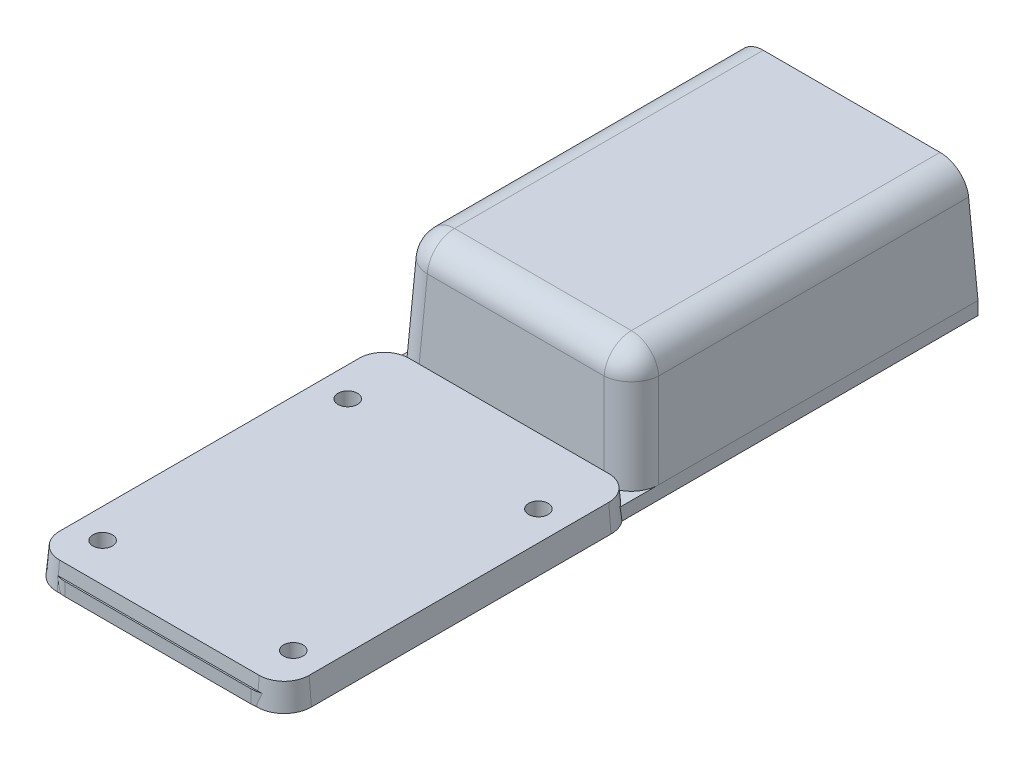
ISO-10303-21;
HEADER;
FILE_DESCRIPTION(('STEP AP214'),'2;1');
FILE_NAME('part.step','',(''),(''),'','','');
FILE_SCHEMA(('AUTOMOTIVE_DESIGN { 1 0 10303 214 1 1 1 1 }'));
ENDSEC;
DATA;
#1=APPLICATION_CONTEXT('core data for automotive mechanical design processes');
#2=APPLICATION_PROTOCOL_DEFINITION('international standard','automotive_design',2000,#1);
#3=PRODUCT_CONTEXT('',#1,'mechanical');
#4=PRODUCT('Part','Part','',(#3));
#5=PRODUCT_RELATED_PRODUCT_CATEGORY('part','',(#4));
#6=PRODUCT_DEFINITION_FORMATION('','',#4);
#7=PRODUCT_DEFINITION_CONTEXT('part definition',#1,'design');
#8=PRODUCT_DEFINITION('design','',#6,#7);
#9=PRODUCT_DEFINITION_SHAPE('','',#8);
#10=(LENGTH_UNIT() NAMED_UNIT(*) SI_UNIT(.MILLI.,.METRE.));
#11=(NAMED_UNIT(*) PLANE_ANGLE_UNIT() SI_UNIT($,.RADIAN.));
#12=(NAMED_UNIT(*) SI_UNIT($,.STERADIAN.) SOLID_ANGLE_UNIT());
#13=UNCERTAINTY_MEASURE_WITH_UNIT(LENGTH_MEASURE(1.E-05),#10,'distance_accuracy_value','');
#14=(GEOMETRIC_REPRESENTATION_CONTEXT(3) GLOBAL_UNCERTAINTY_ASSIGNED_CONTEXT((#13)) GLOBAL_UNIT_ASSIGNED_CONTEXT((#10,
#11,#12)) REPRESENTATION_CONTEXT('',''));
#15=CARTESIAN_POINT('',(0.,0.,0.));
#16=DIRECTION('',(0.,0.,1.));
#17=DIRECTION('',(1.,0.,0.));
#18=AXIS2_PLACEMENT_3D('',#15,#16,#17);
#19=CARTESIAN_POINT('',(20.7387806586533,2.9,33.0766280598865));
#20=DIRECTION('',(0.,-1.,0.));
#21=DIRECTION('',(0.,0.,-1.));
#22=AXIS2_PLACEMENT_3D('',#19,#20,#21);
#23=PLANE('',#22);
#24=CARTESIAN_POINT('',(-22.,2.9,-33.));
#25=DIRECTION('',(0.,-1.,0.));
#26=DIRECTION('',(0.,0.,-1.));
#27=AXIS2_PLACEMENT_3D('',#24,#25,#26);
#28=CIRCLE('',#27,5.74628287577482);
#29=CARTESIAN_POINT('',(-26.2612193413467,2.9,-36.8550974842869));
#30=VERTEX_POINT('',#29);
#31=CARTESIAN_POINT('',(-22.,2.9,-38.7462828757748));
#32=VERTEX_POINT('',#31);
#33=EDGE_CURVE('E319',#30,#32,#28,.T.);
#34=ORIENTED_EDGE('',*,*,#33,.T.);
#35=DIRECTION('',(-1.,0.,0.));
#36=VECTOR('',#35,1.);
#37=CARTESIAN_POINT('',(22.,2.9,-38.7462828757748));
#38=LINE('',#37,#36);
#39=CARTESIAN_POINT('',(-20.269445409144,2.9,-38.7462828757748));
#40=VERTEX_POINT('',#39);
#41=EDGE_CURVE('E11',#32,#40,#38,.F.);
#42=ORIENTED_EDGE('',*,*,#41,.T.);
#43=CARTESIAN_POINT('',(-20.2529852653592,2.9,-44.7545169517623));
#44=DIRECTION('',(0.,-1.,0.));
#45=DIRECTION('',(-0.707106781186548,0.,0.707106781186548));
#46=AXIS2_PLACEMENT_3D('',#43,#44,#45);
#47=ELLIPSE('',#46,6.0164568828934,6.);
#48=CARTESIAN_POINT('',(-26.2612193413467,2.9,-44.7380600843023));
#49=VERTEX_POINT('',#48);
#50=EDGE_CURVE('E544',#40,#49,#47,.T.);
#51=ORIENTED_EDGE('',*,*,#50,.T.);
#52=DIRECTION('',(0.,0.,-1.));
#53=VECTOR('',#52,1.);
#54=CARTESIAN_POINT('',(-26.2612193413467,2.9,33.0766280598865));
#55=LINE('',#54,#53);
#56=EDGE_CURVE('E293',#30,#49,#55,.T.);
#57=ORIENTED_EDGE('',*,*,#56,.F.);
#58=EDGE_LOOP('',(#34,#42,#51,#57));
#59=FACE_BOUND('',#58,.T.);
#60=ADVANCED_FACE('F35',(#59),#23,.F.);
#61=DIRECTION('',(0.,0.,1.));
#62=VECTOR('',#61,1.);
#63=CARTESIAN_POINT('',(26.7387806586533,2.9,33.0766280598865));
#64=LINE('',#63,#62);
#65=CARTESIAN_POINT('',(26.7387806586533,2.9,-44.7380600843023));
#66=VERTEX_POINT('',#65);
#67=CARTESIAN_POINT('',(26.7387806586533,2.9,-36.2501884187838));
#68=VERTEX_POINT('',#67);
#69=EDGE_CURVE('E298',#66,#68,#64,.T.);
#70=ORIENTED_EDGE('',*,*,#69,.F.);
#71=CARTESIAN_POINT('',(20.7305465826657,2.9,-44.7545169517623));
#72=DIRECTION('',(0.,-1.,0.));
#73=DIRECTION('',(0.707106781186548,0.,0.707106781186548));
#74=AXIS2_PLACEMENT_3D('',#71,#72,#73);
#75=ELLIPSE('',#74,6.0164568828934,6.);
#76=CARTESIAN_POINT('',(20.7470034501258,2.9,-38.7462828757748));
#77=VERTEX_POINT('',#76);
#78=EDGE_CURVE('E542',#66,#77,#75,.T.);
#79=ORIENTED_EDGE('',*,*,#78,.T.);
#80=DIRECTION('',(1.,0.,0.));
#81=VECTOR('',#80,1.);
#82=CARTESIAN_POINT('',(20.7387806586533,2.9,-38.7462828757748));
#83=LINE('',#82,#81);
#84=CARTESIAN_POINT('',(22.,2.9,-38.7462828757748));
#85=VERTEX_POINT('',#84);
#86=EDGE_CURVE('E45',#85,#77,#83,.F.);
#87=ORIENTED_EDGE('',*,*,#86,.F.);
#88=CARTESIAN_POINT('',(22.,2.9,-33.));
#89=DIRECTION('',(0.,-1.,0.));
#90=DIRECTION('',(0.,0.,-1.));
#91=AXIS2_PLACEMENT_3D('',#88,#89,#90);
#92=CIRCLE('',#91,5.74628287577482);
#93=EDGE_CURVE('E330',#85,#68,#92,.T.);
#94=ORIENTED_EDGE('',*,*,#93,.T.);
#95=EDGE_LOOP('',(#70,#79,#87,#94));
#96=FACE_BOUND('',#95,.T.);
#97=ADVANCED_FACE('F440',(#96),#23,.F.);
#98=CARTESIAN_POINT('',(22.,0.,39.));
#99=DIRECTION('',(0.,0.0871557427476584,0.996194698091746));
#100=DIRECTION('',(0.,-0.996194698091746,0.0871557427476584));
#101=AXIS2_PLACEMENT_3D('',#98,#99,#100);
#102=PLANE('',#101);
#103=DIRECTION('',(0.,-0.996194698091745,0.0871557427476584));
#104=VECTOR('',#103,1.);
#105=CARTESIAN_POINT('',(22.,0.,39.));
#106=LINE('',#105,#104);
#107=CARTESIAN_POINT('',(22.,0.656378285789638,38.9425743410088));
#108=VERTEX_POINT('',#107);
#109=CARTESIAN_POINT('',(22.,0.,39.));
#110=VERTEX_POINT('',#109);
#111=EDGE_CURVE('E495',#108,#110,#106,.T.);
#112=ORIENTED_EDGE('',*,*,#111,.F.);
#113=CARTESIAN_POINT('',(20.7387806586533,67.7044510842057,33.0766280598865));
#114=DIRECTION('',(0.,0.0871557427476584,0.996194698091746));
#115=DIRECTION('',(0.,-0.996194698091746,0.0871557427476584));
#116=AXIS2_PLACEMENT_3D('',#113,#114,#115);
#117=ELLIPSE('',#116,68.842279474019,6.);
#118=CARTESIAN_POINT('',(21.6946388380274,0.,39.));
#119=VERTEX_POINT('',#118);
#120=EDGE_CURVE('E391',#108,#119,#117,.F.);
#121=ORIENTED_EDGE('',*,*,#120,.T.);
#122=DIRECTION('',(1.,0.,0.));
#123=VECTOR('',#122,1.);
#124=CARTESIAN_POINT('',(22.,0.,39.));
#125=LINE('',#124,#123);
#126=EDGE_CURVE('E659',#119,#110,#125,.T.);
#127=ORIENTED_EDGE('',*,*,#126,.T.);
#128=EDGE_LOOP('',(#112,#121,#127));
#129=FACE_BOUND('',#128,.T.);
#130=ADVANCED_FACE('F410',(#129),#102,.T.);
#131=DIRECTION('',(1.,0.,0.));
#132=VECTOR('',#131,1.);
#133=CARTESIAN_POINT('',(22.,2.9,38.7462828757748));
#134=LINE('',#133,#132);
#135=CARTESIAN_POINT('',(22.,2.9,38.7462828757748));
#136=VERTEX_POINT('',#135);
#137=CARTESIAN_POINT('',(-22.,2.9,38.7462828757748));
#138=VERTEX_POINT('',#137);
#139=EDGE_CURVE('E336',#136,#138,#134,.F.);
#140=ORIENTED_EDGE('',*,*,#139,.F.);
#141=CARTESIAN_POINT('',(22.,5.8,38.4925657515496));
#142=VERTEX_POINT('',#141);
#143=EDGE_CURVE('E459',#142,#136,#106,.T.);
#144=ORIENTED_EDGE('',*,*,#143,.F.);
#145=DIRECTION('',(-1.,0.,0.));
#146=VECTOR('',#145,1.);
#147=CARTESIAN_POINT('',(22.,5.8,38.4925657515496));
#148=LINE('',#147,#146);
#149=CARTESIAN_POINT('',(-22.,5.8,38.4925657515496));
#150=VERTEX_POINT('',#149);
#151=EDGE_CURVE('E463',#150,#142,#148,.F.);
#152=ORIENTED_EDGE('',*,*,#151,.F.);
#153=DIRECTION('',(0.,-0.996194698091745,0.0871557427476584));
#154=VECTOR('',#153,1.);
#155=CARTESIAN_POINT('',(-22.,0.,39.));
#156=LINE('',#155,#154);
#157=EDGE_CURVE('E462',#150,#138,#156,.T.);
#158=ORIENTED_EDGE('',*,*,#157,.T.);
#159=EDGE_LOOP('',(#140,#144,#152,#158));
#160=FACE_BOUND('',#159,.T.);
#161=ADVANCED_FACE('F411',(#160),#102,.T.);
#162=CARTESIAN_POINT('',(22.,0.,-39.));
#163=DIRECTION('',(0.,0.0871557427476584,-0.996194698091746));
#164=DIRECTION('',(0.,0.996194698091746,0.0871557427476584));
#165=AXIS2_PLACEMENT_3D('',#162,#163,#164);
#166=PLANE('',#165);
#167=DIRECTION('',(-1.,0.,0.));
#168=VECTOR('',#167,1.);
#169=CARTESIAN_POINT('',(22.,2.9,-38.7462828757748));
#170=LINE('',#169,#168);
#171=EDGE_CURVE('E53',#40,#77,#170,.F.);
#172=ORIENTED_EDGE('',*,*,#171,.F.);
#173=ORIENTED_EDGE('',*,*,#41,.F.);
#174=DIRECTION('',(0.,-0.996194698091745,-0.0871557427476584));
#175=VECTOR('',#174,1.);
#176=CARTESIAN_POINT('',(-22.,0.,-39.));
#177=LINE('',#176,#175);
#178=CARTESIAN_POINT('',(-22.,5.8,-38.4925657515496));
#179=VERTEX_POINT('',#178);
#180=EDGE_CURVE('E483',#179,#32,#177,.T.);
#181=ORIENTED_EDGE('',*,*,#180,.F.);
#182=DIRECTION('',(1.,0.,0.));
#183=VECTOR('',#182,1.);
#184=CARTESIAN_POINT('',(22.,5.8,-38.4925657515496));
#185=LINE('',#184,#183);
#186=CARTESIAN_POINT('',(22.,5.8,-38.4925657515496));
#187=VERTEX_POINT('',#186);
#188=EDGE_CURVE('E506',#187,#179,#185,.F.);
#189=ORIENTED_EDGE('',*,*,#188,.F.);
#190=DIRECTION('',(0.,-0.996194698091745,-0.0871557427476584));
#191=VECTOR('',#190,1.);
#192=CARTESIAN_POINT('',(22.,0.,-39.));
#193=LINE('',#192,#191);
#194=EDGE_CURVE('E486',#187,#85,#193,.T.);
#195=ORIENTED_EDGE('',*,*,#194,.T.);
#196=ORIENTED_EDGE('',*,*,#86,.T.);
#197=EDGE_LOOP('',(#172,#173,#181,#189,#195,#196));
#198=FACE_BOUND('',#197,.T.);
#199=ADVANCED_FACE('F575',(#198),#166,.T.);
#200=CARTESIAN_POINT('',(-21.,5.8,30.));
#201=DIRECTION('',(0.,1.,0.));
#202=DIRECTION('',(0.,0.,1.));
#203=AXIS2_PLACEMENT_3D('',#200,#201,#202);
#204=CYLINDRICAL_SURFACE('',#203,2.14999999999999);
#205=CARTESIAN_POINT('',(-21.,5.8,30.));
#206=DIRECTION('',(0.,1.,0.));
#207=DIRECTION('',(0.,0.,1.));
#208=AXIS2_PLACEMENT_3D('',#205,#206,#207);
#209=CIRCLE('',#208,2.14999999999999);
#210=CARTESIAN_POINT('',(-21.,5.8,32.15));
#211=VERTEX_POINT('',#210);
#212=EDGE_CURVE('E660',#211,#211,#209,.T.);
#213=ORIENTED_EDGE('',*,*,#212,.T.);
#214=EDGE_LOOP('',(#213));
#215=FACE_BOUND('',#214,.T.);
#216=CARTESIAN_POINT('',(-21.,0.,30.));
#217=DIRECTION('',(0.,1.,0.));
#218=DIRECTION('',(0.,0.,1.));
#219=AXIS2_PLACEMENT_3D('',#216,#217,#218);
#220=CIRCLE('',#219,2.15);
#221=CARTESIAN_POINT('',(-21.,0.,32.15));
#222=VERTEX_POINT('',#221);
#223=EDGE_CURVE('E280',#222,#222,#220,.T.);
#224=ORIENTED_EDGE('',*,*,#223,.F.);
#225=EDGE_LOOP('',(#224));
#226=FACE_BOUND('',#225,.T.);
#227=ADVANCED_FACE('F639',(#215,#226),#204,.F.);
#228=CARTESIAN_POINT('',(21.,5.8,-24.));
#229=DIRECTION('',(0.,1.,0.));
#230=DIRECTION('',(0.,0.,1.));
#231=AXIS2_PLACEMENT_3D('',#228,#229,#230);
#232=CYLINDRICAL_SURFACE('',#231,2.14999999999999);
#233=CARTESIAN_POINT('',(21.,5.8,-24.));
#234=DIRECTION('',(0.,1.,0.));
#235=DIRECTION('',(0.,0.,1.));
#236=AXIS2_PLACEMENT_3D('',#233,#234,#235);
#237=CIRCLE('',#236,2.14999999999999);
#238=CARTESIAN_POINT('',(21.,5.8,-21.85));
#239=VERTEX_POINT('',#238);
#240=EDGE_CURVE('E665',#239,#239,#237,.T.);
#241=ORIENTED_EDGE('',*,*,#240,.T.);
#242=EDGE_LOOP('',(#241));
#243=FACE_BOUND('',#242,.T.);
#244=CARTESIAN_POINT('',(21.,0.,-24.));
#245=DIRECTION('',(0.,1.,0.));
#246=DIRECTION('',(0.,0.,1.));
#247=AXIS2_PLACEMENT_3D('',#244,#245,#246);
#248=CIRCLE('',#247,2.15);
#249=CARTESIAN_POINT('',(21.,0.,-21.85));
#250=VERTEX_POINT('',#249);
#251=EDGE_CURVE('E274',#250,#250,#248,.T.);
#252=ORIENTED_EDGE('',*,*,#251,.F.);
#253=EDGE_LOOP('',(#252));
#254=FACE_BOUND('',#253,.T.);
#255=ADVANCED_FACE('F692',(#243,#254),#232,.F.);
#256=CARTESIAN_POINT('',(21.,5.8,30.));
#257=DIRECTION('',(0.,1.,0.));
#258=DIRECTION('',(0.,0.,1.));
#259=AXIS2_PLACEMENT_3D('',#256,#257,#258);
#260=CYLINDRICAL_SURFACE('',#259,2.14999999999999);
#261=CARTESIAN_POINT('',(21.,5.8,30.));
#262=DIRECTION('',(0.,1.,0.));
#263=DIRECTION('',(0.,0.,1.));
#264=AXIS2_PLACEMENT_3D('',#261,#262,#263);
#265=CIRCLE('',#264,2.14999999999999);
#266=CARTESIAN_POINT('',(21.,5.8,32.15));
#267=VERTEX_POINT('',#266);
#268=EDGE_CURVE('E684',#267,#267,#265,.T.);
#269=ORIENTED_EDGE('',*,*,#268,.T.);
#270=EDGE_LOOP('',(#269));
#271=FACE_BOUND('',#270,.T.);
#272=CARTESIAN_POINT('',(21.,0.,30.));
#273=DIRECTION('',(0.,1.,0.));
#274=DIRECTION('',(0.,0.,1.));
#275=AXIS2_PLACEMENT_3D('',#272,#273,#274);
#276=CIRCLE('',#275,2.15);
#277=CARTESIAN_POINT('',(21.,0.,32.15));
#278=VERTEX_POINT('',#277);
#279=EDGE_CURVE('E277',#278,#278,#276,.T.);
#280=ORIENTED_EDGE('',*,*,#279,.F.);
#281=EDGE_LOOP('',(#280));
#282=FACE_BOUND('',#281,.T.);
#283=ADVANCED_FACE('F711',(#271,#282),#260,.F.);
#284=CARTESIAN_POINT('',(-21.,5.8,-24.));
#285=DIRECTION('',(0.,1.,0.));
#286=DIRECTION('',(0.,0.,1.));
#287=AXIS2_PLACEMENT_3D('',#284,#285,#286);
#288=CYLINDRICAL_SURFACE('',#287,2.14999999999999);
#289=CARTESIAN_POINT('',(-21.,5.8,-24.));
#290=DIRECTION('',(0.,1.,0.));
#291=DIRECTION('',(0.,0.,1.));
#292=AXIS2_PLACEMENT_3D('',#289,#290,#291);
#293=CIRCLE('',#292,2.14999999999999);
#294=CARTESIAN_POINT('',(-21.,5.8,-21.85));
#295=VERTEX_POINT('',#294);
#296=EDGE_CURVE('E682',#295,#295,#293,.T.);
#297=ORIENTED_EDGE('',*,*,#296,.T.);
#298=EDGE_LOOP('',(#297));
#299=FACE_BOUND('',#298,.T.);
#300=CARTESIAN_POINT('',(-21.,0.,-24.));
#301=DIRECTION('',(0.,1.,0.));
#302=DIRECTION('',(0.,0.,1.));
#303=AXIS2_PLACEMENT_3D('',#300,#301,#302);
#304=CIRCLE('',#303,2.15);
#305=CARTESIAN_POINT('',(-21.,0.,-21.85));
#306=VERTEX_POINT('',#305);
#307=EDGE_CURVE('E267',#306,#306,#304,.T.);
#308=ORIENTED_EDGE('',*,*,#307,.F.);
#309=EDGE_LOOP('',(#308));
#310=FACE_BOUND('',#309,.T.);
#311=ADVANCED_FACE('F382',(#299,#310),#288,.F.);
#312=CARTESIAN_POINT('',(-22.,0.,33.));
#313=DIRECTION('',(0.,-1.,0.));
#314=DIRECTION('',(0.,0.,1.));
#315=AXIS2_PLACEMENT_3D('',#312,#313,#314);
#316=CONICAL_SURFACE('',#315,6.,0.0872664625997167);
#317=CARTESIAN_POINT('',(-22.,2.06704177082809,38.819157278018));
#318=VERTEX_POINT('',#317);
#319=CARTESIAN_POINT('',(-22.,0.,39.));
#320=VERTEX_POINT('',#319);
#321=EDGE_CURVE('E468',#318,#320,#156,.T.);
#322=ORIENTED_EDGE('',*,*,#321,.F.);
#323=CARTESIAN_POINT('',(-21.9998,2.06634959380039,38.8192178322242));
#324=CARTESIAN_POINT('',(-22.0399545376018,2.20531903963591,38.8070604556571));
#325=CARTESIAN_POINT('',(-22.0799640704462,2.34429129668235,38.7944880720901));
#326=CARTESIAN_POINT('',(-22.1596931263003,2.62224143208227,38.7685132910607));
#327=CARTESIAN_POINT('',(-22.1994126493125,2.7612193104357,38.7551108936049));
#328=CARTESIAN_POINT('',(-22.2389871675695,2.9002,38.7412934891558));
#329=B_SPLINE_CURVE_WITH_KNOTS('',3,(#323,#324,#325,#326,#327,#328),.UNSPECIFIED.,.F.,.F.,(4,2,
4),(0.,0.435487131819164,0.870974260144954),.UNSPECIFIED.);
#330=CARTESIAN_POINT('',(-22.2389302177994,2.9,38.7413133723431));
#331=VERTEX_POINT('',#330);
#332=EDGE_CURVE('E344',#318,#331,#329,.T.);
#333=ORIENTED_EDGE('',*,*,#332,.T.);
#334=CARTESIAN_POINT('',(-22.,2.9,33.));
#335=DIRECTION('',(0.,-1.,0.));
#336=DIRECTION('',(0.,0.,-1.));
#337=AXIS2_PLACEMENT_3D('',#334,#335,#336);
#338=CIRCLE('',#337,5.74628287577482);
#339=EDGE_CURVE('E339',#138,#331,#338,.T.);
#340=ORIENTED_EDGE('',*,*,#339,.F.);
#341=ORIENTED_EDGE('',*,*,#157,.F.);
#342=CARTESIAN_POINT('',(-22.,5.8,33.));
#343=DIRECTION('',(0.,1.,0.));
#344=DIRECTION('',(0.,0.,1.));
#345=AXIS2_PLACEMENT_3D('',#342,#343,#344);
#346=CIRCLE('',#345,5.49256575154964);
#347=CARTESIAN_POINT('',(-27.4925657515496,5.8,33.));
#348=VERTEX_POINT('',#347);
#349=EDGE_CURVE('E497',#348,#150,#346,.T.);
#350=ORIENTED_EDGE('',*,*,#349,.F.);
#351=DIRECTION('',(-0.0871557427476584,-0.996194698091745,0.));
#352=VECTOR('',#351,1.);
#353=CARTESIAN_POINT('',(-28.,0.,33.));
#354=LINE('',#353,#352);
#355=CARTESIAN_POINT('',(-28.,0.,33.));
#356=VERTEX_POINT('',#355);
#357=EDGE_CURVE('E476',#348,#356,#354,.T.);
#358=ORIENTED_EDGE('',*,*,#357,.T.);
#359=CARTESIAN_POINT('',(-22.,0.,33.));
#360=DIRECTION('',(0.,1.,0.));
#361=DIRECTION('',(0.,0.,1.));
#362=AXIS2_PLACEMENT_3D('',#359,#360,#361);
#363=CIRCLE('',#362,6.);
#364=EDGE_CURVE('E656',#356,#320,#363,.T.);
#365=ORIENTED_EDGE('',*,*,#364,.T.);
#366=EDGE_LOOP('',(#322,#333,#340,#341,#350,#358,#365));
#367=FACE_BOUND('',#366,.T.);
#368=ADVANCED_FACE('F358',(#367),#316,.T.);
#369=CARTESIAN_POINT('',(-21.2170775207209,0.,39.));
#370=VERTEX_POINT('',#369);
#371=EDGE_CURVE('E658',#320,#370,#125,.T.);
#372=ORIENTED_EDGE('',*,*,#371,.T.);
#373=CARTESIAN_POINT('',(-20.2612193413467,67.7044510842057,33.0766280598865));
#374=DIRECTION('',(0.,0.0871557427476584,0.996194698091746));
#375=DIRECTION('',(0.,-0.996194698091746,0.0871557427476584));
#376=AXIS2_PLACEMENT_3D('',#373,#374,#375);
#377=ELLIPSE('',#376,68.842279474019,6.);
#378=EDGE_CURVE('E342',#370,#318,#377,.F.);
#379=ORIENTED_EDGE('',*,*,#378,.T.);
#380=ORIENTED_EDGE('',*,*,#321,.T.);
#381=EDGE_LOOP('',(#372,#379,#380));
#382=FACE_BOUND('',#381,.T.);
#383=ADVANCED_FACE('F405',(#382),#102,.T.);
#384=CARTESIAN_POINT('',(22.,0.,33.));
#385=DIRECTION('',(0.,-1.,0.));
#386=DIRECTION('',(0.,0.,1.));
#387=AXIS2_PLACEMENT_3D('',#384,#385,#386);
#388=CONICAL_SURFACE('',#387,6.,0.0872664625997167);
#389=CARTESIAN_POINT('',(22.,2.9,33.));
#390=DIRECTION('',(0.,-1.,0.));
#391=DIRECTION('',(0.,0.,-1.));
#392=AXIS2_PLACEMENT_3D('',#389,#390,#391);
#393=CIRCLE('',#392,5.74628287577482);
#394=CARTESIAN_POINT('',(22.8934331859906,2.9,38.6764023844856));
#395=VERTEX_POINT('',#394);
#396=EDGE_CURVE('E333',#395,#136,#393,.T.);
#397=ORIENTED_EDGE('',*,*,#396,.F.);
#398=CARTESIAN_POINT('',(22.8935110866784,2.9002,38.6763724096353));
#399=CARTESIAN_POINT('',(22.7478437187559,2.52622098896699,38.7323895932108));
#400=CARTESIAN_POINT('',(22.600534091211,2.1522053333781,38.7825852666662));
#401=CARTESIAN_POINT('',(22.302630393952,1.40410092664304,38.8713335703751));
#402=CARTESIAN_POINT('',(22.1520363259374,1.03001217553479,38.9098862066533));
#403=CARTESIAN_POINT('',(21.9998,0.655886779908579,38.942617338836));
#404=B_SPLINE_CURVE_WITH_KNOTS('',3,(#398,#399,#400,#401,#402,#403),.UNSPECIFIED.,.F.,.F.,(4,2,
4),(0.,1.21530530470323,2.43060998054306),.UNSPECIFIED.);
#405=EDGE_CURVE('E385',#395,#108,#404,.T.);
#406=ORIENTED_EDGE('',*,*,#405,.T.);
#407=ORIENTED_EDGE('',*,*,#111,.T.);
#408=CARTESIAN_POINT('',(22.,0.,33.));
#409=DIRECTION('',(0.,1.,0.));
#410=DIRECTION('',(0.,0.,1.));
#411=AXIS2_PLACEMENT_3D('',#408,#409,#410);
#412=CIRCLE('',#411,6.);
#413=CARTESIAN_POINT('',(28.,0.,33.));
#414=VERTEX_POINT('',#413);
#415=EDGE_CURVE('E669',#110,#414,#412,.T.);
#416=ORIENTED_EDGE('',*,*,#415,.T.);
#417=DIRECTION('',(0.0871557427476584,-0.996194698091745,0.));
#418=VECTOR('',#417,1.);
#419=CARTESIAN_POINT('',(28.,0.,33.));
#420=LINE('',#419,#418);
#421=CARTESIAN_POINT('',(27.4925657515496,5.8,33.));
#422=VERTEX_POINT('',#421);
#423=EDGE_CURVE('E492',#422,#414,#420,.T.);
#424=ORIENTED_EDGE('',*,*,#423,.F.);
#425=CARTESIAN_POINT('',(22.,5.8,33.));
#426=DIRECTION('',(0.,1.,0.));
#427=DIRECTION('',(0.,0.,1.));
#428=AXIS2_PLACEMENT_3D('',#425,#426,#427);
#429=CIRCLE('',#428,5.49256575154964);
#430=EDGE_CURVE('E500',#142,#422,#429,.T.);
#431=ORIENTED_EDGE('',*,*,#430,.F.);
#432=ORIENTED_EDGE('',*,*,#143,.T.);
#433=EDGE_LOOP('',(#397,#406,#407,#416,#424,#431,#432));
#434=FACE_BOUND('',#433,.T.);
#435=ADVANCED_FACE('F399',(#434),#388,.T.);
#436=CARTESIAN_POINT('',(28.,0.,33.));
#437=DIRECTION('',(0.996194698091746,0.0871557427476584,0.));
#438=DIRECTION('',(-0.0871557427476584,0.996194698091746,0.));
#439=AXIS2_PLACEMENT_3D('',#436,#437,#438);
#440=PLANE('',#439);
#441=DIRECTION('',(0.,0.,-1.));
#442=VECTOR('',#441,1.);
#443=CARTESIAN_POINT('',(28.,0.,33.));
#444=LINE('',#443,#442);
#445=CARTESIAN_POINT('',(28.,0.,-33.));
#446=VERTEX_POINT('',#445);
#447=EDGE_CURVE('E671',#414,#446,#444,.T.);
#448=ORIENTED_EDGE('',*,*,#447,.T.);
#449=DIRECTION('',(0.0871557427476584,-0.996194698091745,0.));
#450=VECTOR('',#449,1.);
#451=CARTESIAN_POINT('',(28.,0.,-33.));
#452=LINE('',#451,#450);
#453=CARTESIAN_POINT('',(27.4925657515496,5.8,-33.));
#454=VERTEX_POINT('',#453);
#455=EDGE_CURVE('E489',#454,#446,#452,.T.);
#456=ORIENTED_EDGE('',*,*,#455,.F.);
#457=DIRECTION('',(0.,0.,1.));
#458=VECTOR('',#457,1.);
#459=CARTESIAN_POINT('',(27.4925657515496,5.8,33.));
#460=LINE('',#459,#458);
#461=EDGE_CURVE('E502',#422,#454,#460,.F.);
#462=ORIENTED_EDGE('',*,*,#461,.F.);
#463=ORIENTED_EDGE('',*,*,#423,.T.);
#464=EDGE_LOOP('',(#448,#456,#462,#463));
#465=FACE_BOUND('',#464,.T.);
#466=ADVANCED_FACE('F404',(#465),#440,.T.);
#467=CARTESIAN_POINT('',(22.,0.,-33.));
#468=DIRECTION('',(0.,-1.,0.));
#469=DIRECTION('',(0.,0.,1.));
#470=AXIS2_PLACEMENT_3D('',#467,#468,#469);
#471=CONICAL_SURFACE('',#470,6.,0.0872664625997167);
#472=CARTESIAN_POINT('',(22.,0.,-33.));
#473=DIRECTION('',(0.,1.,0.));
#474=DIRECTION('',(0.,0.,1.));
#475=AXIS2_PLACEMENT_3D('',#472,#473,#474);
#476=CIRCLE('',#475,6.);
#477=CARTESIAN_POINT('',(26.7387806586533,0.,-36.6802116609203));
#478=VERTEX_POINT('',#477);
#479=EDGE_CURVE('E627',#446,#478,#476,.T.);
#480=ORIENTED_EDGE('',*,*,#479,.T.);
#481=CARTESIAN_POINT('',(26.7387806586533,-10.1329618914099,-37.9968095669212));
#482=CARTESIAN_POINT('',(26.7387806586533,-9.2286199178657,-37.8877156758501));
#483=CARTESIAN_POINT('',(26.7387806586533,-8.32446221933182,-37.7770531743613));
#484=CARTESIAN_POINT('',(26.7387806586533,-6.5167254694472,-37.5516242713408));
#485=CARTESIAN_POINT('',(26.7387806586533,-5.61314638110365,-37.4368581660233));
#486=CARTESIAN_POINT('',(26.7387806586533,-3.80730186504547,-37.2023250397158));
#487=CARTESIAN_POINT('',(26.7387806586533,-2.9050359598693,-37.0825617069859));
#488=CARTESIAN_POINT('',(26.7387806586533,-1.10131732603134,-36.8364622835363));
#489=CARTESIAN_POINT('',(26.7387806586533,-0.19986467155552,-36.7101256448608));
#490=CARTESIAN_POINT('',(26.7387806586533,1.15180094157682,-36.5139124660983));
#491=CARTESIAN_POINT('',(26.7387806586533,1.60249580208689,-36.4473550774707));
#492=CARTESIAN_POINT('',(26.7387806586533,2.50348349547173,-36.3115971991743));
#493=CARTESIAN_POINT('',(26.7387806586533,2.95377633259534,-36.2423967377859));
#494=CARTESIAN_POINT('',(26.7387806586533,3.85377205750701,-36.1008320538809));
#495=CARTESIAN_POINT('',(26.7387806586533,4.30347504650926,-36.0284684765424));
#496=CARTESIAN_POINT('',(26.7387806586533,5.2022556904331,-35.8798319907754));
#497=CARTESIAN_POINT('',(26.7387806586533,5.65133332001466,-35.8035589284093));
#498=CARTESIAN_POINT('',(26.7387806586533,6.5490115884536,-35.6460054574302));
#499=CARTESIAN_POINT('',(26.7387806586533,6.99761148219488,-35.5647207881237));
#500=CARTESIAN_POINT('',(26.7387806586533,7.89355866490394,-35.3956961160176));
#501=CARTESIAN_POINT('',(26.7387806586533,8.34090608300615,-35.3079568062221));
#502=CARTESIAN_POINT('',(26.7387806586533,9.01069878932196,-35.1695971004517));
#503=CARTESIAN_POINT('',(26.7387806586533,9.23383707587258,-35.1223341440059));
#504=CARTESIAN_POINT('',(26.7387806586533,9.67950950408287,-35.0250738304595));
#505=CARTESIAN_POINT('',(26.7387806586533,9.90204366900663,-34.9750765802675));
#506=CARTESIAN_POINT('',(26.7387806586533,10.3464204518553,-34.8717165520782));
#507=CARTESIAN_POINT('',(26.7387806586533,10.5682627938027,-34.8183525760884));
#508=CARTESIAN_POINT('',(26.7387806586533,11.0108742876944,-34.7072387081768));
#509=CARTESIAN_POINT('',(26.7387806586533,11.2316432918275,-34.6494882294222));
#510=CARTESIAN_POINT('',(26.7387806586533,11.4516950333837,-34.5890332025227));
#511=B_SPLINE_CURVE_WITH_KNOTS('',3,(#481,#482,#483,#484,#485,#486,#487,#488,#489,#490,#491,
#492,#493,#494,#495,#496,#497,#498,#499,#500,#501,#502,#503,#504,#505,#506,#507,#508,#509,#510),
.UNSPECIFIED.,.F.,.F.,(4,2,2,2,2,2,2,2,2,2,2,2,2,2,4),(0.,2.73270133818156,5.46520581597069,
8.1957280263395,10.9264782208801,12.2932207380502,13.6599486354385,15.0263990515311,
16.3929033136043,17.760585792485,19.1281216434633,19.8123742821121,20.4966001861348,
21.1810709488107,21.8656334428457),.UNSPECIFIED.);
#512=EDGE_CURVE('E392',#478,#68,#511,.T.);
#513=ORIENTED_EDGE('',*,*,#512,.T.);
#514=ORIENTED_EDGE('',*,*,#93,.F.);
#515=ORIENTED_EDGE('',*,*,#194,.F.);
#516=CARTESIAN_POINT('',(22.,5.8,-33.));
#517=DIRECTION('',(0.,1.,0.));
#518=DIRECTION('',(0.,0.,1.));
#519=AXIS2_PLACEMENT_3D('',#516,#517,#518);
#520=CIRCLE('',#519,5.49256575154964);
#521=EDGE_CURVE('E504',#454,#187,#520,.T.);
#522=ORIENTED_EDGE('',*,*,#521,.F.);
#523=ORIENTED_EDGE('',*,*,#455,.T.);
#524=EDGE_LOOP('',(#480,#513,#514,#515,#522,#523));
#525=FACE_BOUND('',#524,.T.);
#526=ADVANCED_FACE('F626',(#525),#471,.T.);
#527=CARTESIAN_POINT('',(-22.,0.,-33.));
#528=DIRECTION('',(0.,-1.,0.));
#529=DIRECTION('',(0.,0.,1.));
#530=AXIS2_PLACEMENT_3D('',#527,#528,#529);
#531=CONICAL_SURFACE('',#530,6.,0.0872664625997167);
#532=ORIENTED_EDGE('',*,*,#33,.F.);
#533=CARTESIAN_POINT('',(-26.2612193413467,11.580876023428,-35.590411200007));
#534=CARTESIAN_POINT('',(-26.2612193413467,11.2037676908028,-35.6538961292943));
#535=CARTESIAN_POINT('',(-26.2612193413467,10.826393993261,-35.7157803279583));
#536=CARTESIAN_POINT('',(-26.2612193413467,10.0712156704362,-35.836826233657));
#537=CARTESIAN_POINT('',(-26.2612193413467,9.69341105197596,-35.8959879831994));
#538=CARTESIAN_POINT('',(-26.2612193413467,8.93747665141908,-36.0120671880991));
#539=CARTESIAN_POINT('',(-26.2612193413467,8.55934688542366,-36.0689847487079));
#540=CARTESIAN_POINT('',(-26.2612193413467,7.80280343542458,-36.1809092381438));
#541=CARTESIAN_POINT('',(-26.2612193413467,7.42438975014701,-36.2359161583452));
#542=CARTESIAN_POINT('',(-26.2612193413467,6.28888517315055,-36.3984768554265));
#543=CARTESIAN_POINT('',(-26.2612193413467,5.53144389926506,-36.5035837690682));
#544=CARTESIAN_POINT('',(-26.2612193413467,4.01588568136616,-36.7088320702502));
#545=CARTESIAN_POINT('',(-26.2612193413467,3.25776873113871,-36.8089734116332));
#546=CARTESIAN_POINT('',(-26.2612193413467,2.21205444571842,-36.9443446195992));
#547=CARTESIAN_POINT('',(-26.2612193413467,1.9246742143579,-36.9812597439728));
#548=CARTESIAN_POINT('',(-26.2612193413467,1.34984424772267,-37.0545671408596));
#549=CARTESIAN_POINT('',(-26.2612193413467,1.06239451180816,-37.0909594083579));
#550=CARTESIAN_POINT('',(-26.2612193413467,-0.127473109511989,-37.2405923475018));
#551=CARTESIAN_POINT('',(-26.2612193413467,-1.0301585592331,-37.3517087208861));
#552=CARTESIAN_POINT('',(-26.2612193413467,-2.83598532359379,-37.5701911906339));
#553=CARTESIAN_POINT('',(-26.2612193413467,-3.73912664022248,-37.6775572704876));
#554=CARTESIAN_POINT('',(-26.2612193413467,-5.54572264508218,-37.8892373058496));
#555=CARTESIAN_POINT('',(-26.2612193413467,-6.44917731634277,-37.9935514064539));
#556=CARTESIAN_POINT('',(-26.2612193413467,-8.25636846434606,-38.1996297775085));
#557=CARTESIAN_POINT('',(-26.2612193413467,-9.16010493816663,-38.3013940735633));
#558=CARTESIAN_POINT('',(-26.2612193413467,-10.0639541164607,-38.4021329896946));
#559=B_SPLINE_CURVE_WITH_KNOTS('',3,(#533,#534,#535,#536,#537,#538,#539,#540,#541,#542,#543,
#544,#545,#546,#547,#548,#549,#550,#551,#552,#553,#554,#555,#556,#557,#558),.UNSPECIFIED.,.F.,
.F.,(4,2,2,2,2,2,2,2,2,2,2,2,4),(0.,1.14723489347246,2.29445186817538,3.44161497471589,
4.58878325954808,6.88285626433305,9.17695058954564,10.0461746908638,10.9154071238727,
13.6438916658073,16.3723882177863,19.1007548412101,21.8290940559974),.UNSPECIFIED.);
#560=CARTESIAN_POINT('',(-26.2612193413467,0.,-37.2239803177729));
#561=VERTEX_POINT('',#560);
#562=EDGE_CURVE('E351',#30,#561,#559,.T.);
#563=ORIENTED_EDGE('',*,*,#562,.T.);
#564=CARTESIAN_POINT('',(-22.,0.,-33.));
#565=DIRECTION('',(0.,1.,0.));
#566=DIRECTION('',(0.,0.,1.));
#567=AXIS2_PLACEMENT_3D('',#564,#565,#566);
#568=CIRCLE('',#567,6.);
#569=CARTESIAN_POINT('',(-28.,0.,-33.));
#570=VERTEX_POINT('',#569);
#571=EDGE_CURVE('E619',#561,#570,#568,.T.);
#572=ORIENTED_EDGE('',*,*,#571,.T.);
#573=DIRECTION('',(-0.0871557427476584,-0.996194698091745,0.));
#574=VECTOR('',#573,1.);
#575=CARTESIAN_POINT('',(-28.,0.,-33.));
#576=LINE('',#575,#574);
#577=CARTESIAN_POINT('',(-27.4925657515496,5.8,-33.));
#578=VERTEX_POINT('',#577);
#579=EDGE_CURVE('E479',#578,#570,#576,.T.);
#580=ORIENTED_EDGE('',*,*,#579,.F.);
#581=CARTESIAN_POINT('',(-22.,5.8,-33.));
#582=DIRECTION('',(0.,1.,0.));
#583=DIRECTION('',(0.,0.,1.));
#584=AXIS2_PLACEMENT_3D('',#581,#582,#583);
#585=CIRCLE('',#584,5.49256575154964);
#586=EDGE_CURVE('E508',#179,#578,#585,.T.);
#587=ORIENTED_EDGE('',*,*,#586,.F.);
#588=ORIENTED_EDGE('',*,*,#180,.T.);
#589=EDGE_LOOP('',(#532,#563,#572,#580,#587,#588));
#590=FACE_BOUND('',#589,.T.);
#591=ADVANCED_FACE('F617',(#590),#531,.T.);
#592=CARTESIAN_POINT('',(-28.,0.,33.));
#593=DIRECTION('',(-0.996194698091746,0.0871557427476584,0.));
#594=DIRECTION('',(-0.0871557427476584,-0.996194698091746,0.));
#595=AXIS2_PLACEMENT_3D('',#592,#593,#594);
#596=PLANE('',#595);
#597=DIRECTION('',(0.,0.,1.));
#598=VECTOR('',#597,1.);
#599=CARTESIAN_POINT('',(-28.,0.,33.));
#600=LINE('',#599,#598);
#601=EDGE_CURVE('E474',#570,#356,#600,.T.);
#602=ORIENTED_EDGE('',*,*,#601,.T.);
#603=ORIENTED_EDGE('',*,*,#357,.F.);
#604=DIRECTION('',(0.,0.,-1.));
#605=VECTOR('',#604,1.);
#606=CARTESIAN_POINT('',(-27.4925657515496,5.8,33.));
#607=LINE('',#606,#605);
#608=EDGE_CURVE('E480',#578,#348,#607,.F.);
#609=ORIENTED_EDGE('',*,*,#608,.F.);
#610=ORIENTED_EDGE('',*,*,#579,.T.);
#611=EDGE_LOOP('',(#602,#603,#609,#610));
#612=FACE_BOUND('',#611,.T.);
#613=ADVANCED_FACE('F633',(#612),#596,.T.);
#614=CARTESIAN_POINT('',(-22.,5.8,33.));
#615=DIRECTION('',(0.,1.,0.));
#616=DIRECTION('',(0.,0.,1.));
#617=AXIS2_PLACEMENT_3D('',#614,#615,#616);
#618=PLANE('',#617);
#619=ORIENTED_EDGE('',*,*,#296,.F.);
#620=EDGE_LOOP('',(#619));
#621=FACE_BOUND('',#620,.T.);
#622=ORIENTED_EDGE('',*,*,#268,.F.);
#623=EDGE_LOOP('',(#622));
#624=FACE_BOUND('',#623,.T.);
#625=ORIENTED_EDGE('',*,*,#240,.F.);
#626=EDGE_LOOP('',(#625));
#627=FACE_BOUND('',#626,.T.);
#628=ORIENTED_EDGE('',*,*,#212,.F.);
#629=EDGE_LOOP('',(#628));
#630=FACE_BOUND('',#629,.T.);
#631=ORIENTED_EDGE('',*,*,#349,.T.);
#632=ORIENTED_EDGE('',*,*,#151,.T.);
#633=ORIENTED_EDGE('',*,*,#430,.T.);
#634=ORIENTED_EDGE('',*,*,#461,.T.);
#635=ORIENTED_EDGE('',*,*,#521,.T.);
#636=ORIENTED_EDGE('',*,*,#188,.T.);
#637=ORIENTED_EDGE('',*,*,#586,.T.);
#638=ORIENTED_EDGE('',*,*,#608,.T.);
#639=EDGE_LOOP('',(#631,#632,#633,#634,#635,#636,#637,#638));
#640=FACE_BOUND('',#639,.T.);
#641=ADVANCED_FACE('F622',(#621,#624,#627,#630,#640),#618,.T.);
#642=CARTESIAN_POINT('',(-22.,0.,33.));
#643=DIRECTION('',(0.,1.,0.));
#644=DIRECTION('',(0.,0.,1.));
#645=AXIS2_PLACEMENT_3D('',#642,#643,#644);
#646=PLANE('',#645);
#647=ORIENTED_EDGE('',*,*,#307,.T.);
#648=EDGE_LOOP('',(#647));
#649=FACE_BOUND('',#648,.T.);
#650=ORIENTED_EDGE('',*,*,#251,.T.);
#651=EDGE_LOOP('',(#650));
#652=FACE_BOUND('',#651,.T.);
#653=ORIENTED_EDGE('',*,*,#279,.T.);
#654=EDGE_LOOP('',(#653));
#655=FACE_BOUND('',#654,.T.);
#656=ORIENTED_EDGE('',*,*,#223,.T.);
#657=EDGE_LOOP('',(#656));
#658=FACE_BOUND('',#657,.T.);
#659=DIRECTION('',(0.,0.,1.));
#660=VECTOR('',#659,1.);
#661=CARTESIAN_POINT('',(26.7387806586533,0.,33.0766280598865));
#662=LINE('',#661,#660);
#663=CARTESIAN_POINT('',(26.7387806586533,0.,-115.101371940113));
#664=VERTEX_POINT('',#663);
#665=EDGE_CURVE('E287',#664,#478,#662,.T.);
#666=ORIENTED_EDGE('',*,*,#665,.T.);
#667=ORIENTED_EDGE('',*,*,#479,.F.);
#668=ORIENTED_EDGE('',*,*,#447,.F.);
#669=ORIENTED_EDGE('',*,*,#415,.F.);
#670=ORIENTED_EDGE('',*,*,#126,.F.);
#671=CARTESIAN_POINT('',(20.7387806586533,0.,33.0766280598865));
#672=DIRECTION('',(0.,-1.,0.));
#673=DIRECTION('',(0.,0.,-1.));
#674=AXIS2_PLACEMENT_3D('',#671,#672,#673);
#675=CIRCLE('',#674,6.);
#676=CARTESIAN_POINT('',(20.7387806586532,0.,39.0766280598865));
#677=VERTEX_POINT('',#676);
#678=EDGE_CURVE('E283',#119,#677,#675,.T.);
#679=ORIENTED_EDGE('',*,*,#678,.T.);
#680=DIRECTION('',(-1.,0.,0.));
#681=VECTOR('',#680,1.);
#682=CARTESIAN_POINT('',(-20.2612193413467,0.,39.0766280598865));
#683=LINE('',#682,#681);
#684=CARTESIAN_POINT('',(-20.2612193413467,0.,39.0766280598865));
#685=VERTEX_POINT('',#684);
#686=EDGE_CURVE('E304',#677,#685,#683,.T.);
#687=ORIENTED_EDGE('',*,*,#686,.T.);
#688=CARTESIAN_POINT('',(-20.2612193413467,0.,33.0766280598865));
#689=DIRECTION('',(0.,-1.,0.));
#690=DIRECTION('',(0.,0.,1.));
#691=AXIS2_PLACEMENT_3D('',#688,#689,#690);
#692=CIRCLE('',#691,6.);
#693=EDGE_CURVE('E307',#685,#370,#692,.T.);
#694=ORIENTED_EDGE('',*,*,#693,.T.);
#695=ORIENTED_EDGE('',*,*,#371,.F.);
#696=ORIENTED_EDGE('',*,*,#364,.F.);
#697=ORIENTED_EDGE('',*,*,#601,.F.);
#698=ORIENTED_EDGE('',*,*,#571,.F.);
#699=DIRECTION('',(0.,0.,-1.));
#700=VECTOR('',#699,1.);
#701=CARTESIAN_POINT('',(-26.2612193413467,0.,33.0766280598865));
#702=LINE('',#701,#700);
#703=CARTESIAN_POINT('',(-26.2612193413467,0.,-115.101371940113));
#704=VERTEX_POINT('',#703);
#705=EDGE_CURVE('E310',#561,#704,#702,.T.);
#706=ORIENTED_EDGE('',*,*,#705,.T.);
#707=DIRECTION('',(1.,0.,0.));
#708=VECTOR('',#707,1.);
#709=CARTESIAN_POINT('',(-26.2612193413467,0.,-115.101371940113));
#710=LINE('',#709,#708);
#711=EDGE_CURVE('E312',#704,#664,#710,.T.);
#712=ORIENTED_EDGE('',*,*,#711,.T.);
#713=EDGE_LOOP('',(#666,#667,#668,#669,#670,#679,#687,#694,#695,#696,#697,#698,#706,#712));
#714=FACE_BOUND('',#713,.T.);
#715=ADVANCED_FACE('F609',(#649,#652,#655,#658,#714),#646,.F.);
#716=CARTESIAN_POINT('',(-26.2612193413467,2.9,-115.101371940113));
#717=DIRECTION('',(0.,0.,-1.));
#718=DIRECTION('',(-1.,0.,0.));
#719=AXIS2_PLACEMENT_3D('',#716,#717,#718);
#720=PLANE('',#719);
#721=ORIENTED_EDGE('',*,*,#711,.F.);
#722=DIRECTION('',(0.,-1.,0.));
#723=VECTOR('',#722,1.);
#724=CARTESIAN_POINT('',(-26.2612193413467,2.9,-115.101371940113));
#725=LINE('',#724,#723);
#726=CARTESIAN_POINT('',(-26.2612193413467,2.9,-115.101371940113));
#727=VERTEX_POINT('',#726);
#728=EDGE_CURVE('E320',#727,#704,#725,.T.);
#729=ORIENTED_EDGE('',*,*,#728,.F.);
#730=DIRECTION('',(1.,0.,0.));
#731=VECTOR('',#730,1.);
#732=CARTESIAN_POINT('',(-26.2612193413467,2.9,-115.101371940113));
#733=LINE('',#732,#731);
#734=CARTESIAN_POINT('',(26.7387806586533,2.9,-115.101371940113));
#735=VERTEX_POINT('',#734);
#736=EDGE_CURVE('E295',#727,#735,#733,.T.);
#737=ORIENTED_EDGE('',*,*,#736,.T.);
#738=DIRECTION('',(0.,-1.,0.));
#739=VECTOR('',#738,1.);
#740=CARTESIAN_POINT('',(26.7387806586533,2.9,-115.101371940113));
#741=LINE('',#740,#739);
#742=EDGE_CURVE('E317',#735,#664,#741,.T.);
#743=ORIENTED_EDGE('',*,*,#742,.T.);
#744=EDGE_LOOP('',(#721,#729,#737,#743));
#745=FACE_BOUND('',#744,.T.);
#746=ADVANCED_FACE('F605',(#745),#720,.T.);
#747=CARTESIAN_POINT('',(-26.2612193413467,2.9,33.0766280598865));
#748=DIRECTION('',(-1.,0.,0.));
#749=DIRECTION('',(0.,0.,1.));
#750=AXIS2_PLACEMENT_3D('',#747,#748,#749);
#751=PLANE('',#750);
#752=ORIENTED_EDGE('',*,*,#562,.F.);
#753=ORIENTED_EDGE('',*,*,#56,.T.);
#754=DIRECTION('',(0.,0.,1.));
#755=VECTOR('',#754,1.);
#756=CARTESIAN_POINT('',(-26.2612193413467,2.9,-38.7462828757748));
#757=LINE('',#756,#755);
#758=EDGE_CURVE('E257',#727,#49,#757,.T.);
#759=ORIENTED_EDGE('',*,*,#758,.F.);
#760=ORIENTED_EDGE('',*,*,#728,.T.);
#761=ORIENTED_EDGE('',*,*,#705,.F.);
#762=EDGE_LOOP('',(#752,#753,#759,#760,#761));
#763=FACE_BOUND('',#762,.T.);
#764=ADVANCED_FACE('F369',(#763),#751,.T.);
#765=CARTESIAN_POINT('',(26.7387806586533,2.9,33.0766280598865));
#766=DIRECTION('',(1.,0.,0.));
#767=DIRECTION('',(0.,0.,-1.));
#768=AXIS2_PLACEMENT_3D('',#765,#766,#767);
#769=PLANE('',#768);
#770=ORIENTED_EDGE('',*,*,#512,.F.);
#771=ORIENTED_EDGE('',*,*,#665,.F.);
#772=ORIENTED_EDGE('',*,*,#742,.F.);
#773=EDGE_CURVE('E299',#735,#66,#64,.T.);
#774=ORIENTED_EDGE('',*,*,#773,.T.);
#775=ORIENTED_EDGE('',*,*,#69,.T.);
#776=EDGE_LOOP('',(#770,#771,#772,#774,#775));
#777=FACE_BOUND('',#776,.T.);
#778=ADVANCED_FACE('F380',(#777),#769,.T.);
#779=CARTESIAN_POINT('',(20.7387806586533,2.9,33.0766280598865));
#780=DIRECTION('',(0.,-1.,0.));
#781=DIRECTION('',(0.,0.,-1.));
#782=AXIS2_PLACEMENT_3D('',#779,#780,#781);
#783=CYLINDRICAL_SURFACE('',#782,6.);
#784=ORIENTED_EDGE('',*,*,#120,.F.);
#785=ORIENTED_EDGE('',*,*,#405,.F.);
#786=CARTESIAN_POINT('',(20.7387806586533,2.9,33.0766280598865));
#787=DIRECTION('',(0.,-1.,0.));
#788=DIRECTION('',(0.,0.,-1.));
#789=AXIS2_PLACEMENT_3D('',#786,#787,#788);
#790=CIRCLE('',#789,6.);
#791=CARTESIAN_POINT('',(20.7387806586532,2.9,39.0766280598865));
#792=VERTEX_POINT('',#791);
#793=EDGE_CURVE('E284',#395,#792,#790,.T.);
#794=ORIENTED_EDGE('',*,*,#793,.T.);
#795=DIRECTION('',(0.,-1.,0.));
#796=VECTOR('',#795,1.);
#797=CARTESIAN_POINT('',(20.7387806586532,2.9,39.0766280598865));
#798=LINE('',#797,#796);
#799=EDGE_CURVE('E302',#792,#677,#798,.T.);
#800=ORIENTED_EDGE('',*,*,#799,.T.);
#801=ORIENTED_EDGE('',*,*,#678,.F.);
#802=EDGE_LOOP('',(#784,#785,#794,#800,#801));
#803=FACE_BOUND('',#802,.T.);
#804=ADVANCED_FACE('F367',(#803),#783,.T.);
#805=CARTESIAN_POINT('',(-20.2612193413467,2.9,33.0766280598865));
#806=DIRECTION('',(0.,-1.,0.));
#807=DIRECTION('',(0.,0.,-1.));
#808=AXIS2_PLACEMENT_3D('',#805,#806,#807);
#809=CYLINDRICAL_SURFACE('',#808,6.);
#810=ORIENTED_EDGE('',*,*,#332,.F.);
#811=ORIENTED_EDGE('',*,*,#378,.F.);
#812=ORIENTED_EDGE('',*,*,#693,.F.);
#813=DIRECTION('',(0.,-1.,0.));
#814=VECTOR('',#813,1.);
#815=CARTESIAN_POINT('',(-20.2612193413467,2.9,39.0766280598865));
#816=LINE('',#815,#814);
#817=CARTESIAN_POINT('',(-20.2612193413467,2.9,39.0766280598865));
#818=VERTEX_POINT('',#817);
#819=EDGE_CURVE('E323',#818,#685,#816,.T.);
#820=ORIENTED_EDGE('',*,*,#819,.F.);
#821=CARTESIAN_POINT('',(-20.2612193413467,2.9,33.0766280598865));
#822=DIRECTION('',(0.,-1.,0.));
#823=DIRECTION('',(0.,0.,1.));
#824=AXIS2_PLACEMENT_3D('',#821,#822,#823);
#825=CIRCLE('',#824,6.);
#826=EDGE_CURVE('E290',#818,#331,#825,.T.);
#827=ORIENTED_EDGE('',*,*,#826,.T.);
#828=EDGE_LOOP('',(#810,#811,#812,#820,#827));
#829=FACE_BOUND('',#828,.T.);
#830=ADVANCED_FACE('F362',(#829),#809,.T.);
#831=ORIENTED_EDGE('',*,*,#139,.T.);
#832=ORIENTED_EDGE('',*,*,#339,.T.);
#833=ORIENTED_EDGE('',*,*,#826,.F.);
#834=DIRECTION('',(-1.,0.,0.));
#835=VECTOR('',#834,1.);
#836=CARTESIAN_POINT('',(-20.2612193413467,2.9,39.0766280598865));
#837=LINE('',#836,#835);
#838=EDGE_CURVE('E286',#792,#818,#837,.T.);
#839=ORIENTED_EDGE('',*,*,#838,.F.);
#840=ORIENTED_EDGE('',*,*,#793,.F.);
#841=ORIENTED_EDGE('',*,*,#396,.T.);
#842=EDGE_LOOP('',(#831,#832,#833,#839,#840,#841));
#843=FACE_BOUND('',#842,.T.);
#844=ADVANCED_FACE('F366',(#843),#23,.F.);
#845=CARTESIAN_POINT('',(-20.2612193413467,2.9,39.0766280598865));
#846=DIRECTION('',(0.,0.,1.));
#847=DIRECTION('',(1.,0.,0.));
#848=AXIS2_PLACEMENT_3D('',#845,#846,#847);
#849=PLANE('',#848);
#850=ORIENTED_EDGE('',*,*,#686,.F.);
#851=ORIENTED_EDGE('',*,*,#799,.F.);
#852=ORIENTED_EDGE('',*,*,#838,.T.);
#853=ORIENTED_EDGE('',*,*,#819,.T.);
#854=EDGE_LOOP('',(#850,#851,#852,#853));
#855=FACE_BOUND('',#854,.T.);
#856=ADVANCED_FACE('F372',(#855),#849,.T.);
#857=CARTESIAN_POINT('',(26.7387806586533,2.9,-38.7462828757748));
#858=DIRECTION('',(0.998629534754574,0.0523359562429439,0.));
#859=DIRECTION('',(-0.052335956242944,0.998629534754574,0.));
#860=AXIS2_PLACEMENT_3D('',#857,#858,#859);
#861=PLANE('',#860);
#862=DIRECTION('',(0.,0.,-1.));
#863=VECTOR('',#862,1.);
#864=CARTESIAN_POINT('',(25.7056128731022,22.6140157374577,-40.0774404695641));
#865=LINE('',#864,#863);
#866=CARTESIAN_POINT('',(25.7056128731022,22.6140157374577,-114.068204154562));
#867=VERTEX_POINT('',#866);
#868=CARTESIAN_POINT('',(25.7056128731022,22.6140157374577,-45.7712278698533));
#869=VERTEX_POINT('',#868);
#870=EDGE_CURVE('E517',#867,#869,#865,.F.);
#871=ORIENTED_EDGE('',*,*,#870,.T.);
#872=DIRECTION('',(-0.052264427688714,0.997264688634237,-0.0522644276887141));
#873=VECTOR('',#872,1.);
#874=CARTESIAN_POINT('',(26.7551476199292,2.58769977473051,-44.7216931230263));
#875=LINE('',#874,#873);
#876=EDGE_CURVE('E519',#869,#66,#875,.F.);
#877=ORIENTED_EDGE('',*,*,#876,.T.);
#878=ORIENTED_EDGE('',*,*,#773,.F.);
#879=DIRECTION('',(0.052264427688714,-0.997264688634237,-0.052264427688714));
#880=VECTOR('',#879,1.);
#881=CARTESIAN_POINT('',(26.7387806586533,2.9,-115.101371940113));
#882=LINE('',#881,#880);
#883=EDGE_CURVE('E265',#867,#735,#882,.T.);
#884=ORIENTED_EDGE('',*,*,#883,.F.);
#885=EDGE_LOOP('',(#871,#877,#878,#884));
#886=FACE_BOUND('',#885,.T.);
#887=ADVANCED_FACE('F375',(#886),#861,.T.);
#888=CARTESIAN_POINT('',(26.7387806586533,2.9,-115.101371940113));
#889=DIRECTION('',(0.,0.0523359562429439,-0.998629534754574));
#890=DIRECTION('',(0.,0.998629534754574,0.052335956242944));
#891=AXIS2_PLACEMENT_3D('',#888,#889,#890);
#892=PLANE('',#891);
#893=DIRECTION('',(-1.,0.,0.));
#894=VECTOR('',#893,1.);
#895=CARTESIAN_POINT('',(26.7387806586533,6.80497279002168,-114.896720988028));
#896=LINE('',#895,#894);
#897=CARTESIAN_POINT('',(-21.5492485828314,6.80497279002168,-114.896720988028));
#898=VERTEX_POINT('',#897);
#899=CARTESIAN_POINT('',(22.1712557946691,6.80497279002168,-114.896720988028));
#900=VERTEX_POINT('',#899);
#901=EDGE_CURVE('E467',#898,#900,#896,.F.);
#902=ORIENTED_EDGE('',*,*,#901,.T.);
#903=DIRECTION('',(0.,-0.998629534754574,-0.052335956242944));
#904=VECTOR('',#903,1.);
#905=CARTESIAN_POINT('',(22.1712557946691,2.9,-115.101371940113));
#906=LINE('',#905,#904);
#907=CARTESIAN_POINT('',(22.1712557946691,23.9069594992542,-114.000443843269));
#908=VERTEX_POINT('',#907);
#909=EDGE_CURVE('E232',#900,#908,#906,.F.);
#910=ORIENTED_EDGE('',*,*,#909,.T.);
#911=DIRECTION('',(1.,0.,0.));
#912=VECTOR('',#911,1.);
#913=CARTESIAN_POINT('',(26.7387806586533,23.9069594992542,-114.000443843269));
#914=LINE('',#913,#912);
#915=CARTESIAN_POINT('',(-21.5492485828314,23.9069594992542,-114.000443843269));
#916=VERTEX_POINT('',#915);
#917=EDGE_CURVE('E513',#908,#916,#914,.F.);
#918=ORIENTED_EDGE('',*,*,#917,.T.);
#919=DIRECTION('',(0.,0.998629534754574,0.052335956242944));
#920=VECTOR('',#919,1.);
#921=CARTESIAN_POINT('',(-21.5492485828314,2.9,-115.101371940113));
#922=LINE('',#921,#920);
#923=EDGE_CURVE('E470',#916,#898,#922,.F.);
#924=ORIENTED_EDGE('',*,*,#923,.T.);
#925=EDGE_LOOP('',(#902,#910,#918,#924));
#926=FACE_BOUND('',#925,.T.);
#927=DIRECTION('',(1.,0.,0.));
#928=VECTOR('',#927,1.);
#929=CARTESIAN_POINT('',(26.7387806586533,28.3,-113.770214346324));
#930=LINE('',#929,#928);
#931=CARTESIAN_POINT('',(19.7138356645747,28.3,-113.770214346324));
#932=VERTEX_POINT('',#931);
#933=CARTESIAN_POINT('',(-19.2362743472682,28.3,-113.770214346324));
#934=VERTEX_POINT('',#933);
#935=EDGE_CURVE('E264',#932,#934,#930,.F.);
#936=ORIENTED_EDGE('',*,*,#935,.F.);
#937=CARTESIAN_POINT('',(19.7138356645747,22.3,-114.084661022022));
#938=DIRECTION('',(0.,0.0523359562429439,-0.998629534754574));
#939=DIRECTION('',(0.,-0.998629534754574,-0.052335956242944));
#940=AXIS2_PLACEMENT_3D('',#937,#938,#939);
#941=ELLIPSE('',#940,6.00823407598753,6.);
#942=EDGE_CURVE('E540',#932,#867,#941,.T.);
#943=ORIENTED_EDGE('',*,*,#942,.T.);
#944=ORIENTED_EDGE('',*,*,#883,.T.);
#945=ORIENTED_EDGE('',*,*,#736,.F.);
#946=DIRECTION('',(-0.052264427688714,-0.997264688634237,-0.052264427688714));
#947=VECTOR('',#946,1.);
#948=CARTESIAN_POINT('',(-26.0526500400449,6.87973934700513,-114.892802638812));
#949=LINE('',#948,#947);
#950=CARTESIAN_POINT('',(-25.2280515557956,22.6140157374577,-114.068204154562));
#951=VERTEX_POINT('',#950);
#952=EDGE_CURVE('E268',#951,#727,#949,.T.);
#953=ORIENTED_EDGE('',*,*,#952,.F.);
#954=CARTESIAN_POINT('',(-19.2362743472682,22.3,-114.084661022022));
#955=DIRECTION('',(0.,0.0523359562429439,-0.998629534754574));
#956=DIRECTION('',(0.,0.998629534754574,0.052335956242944));
#957=AXIS2_PLACEMENT_3D('',#954,#955,#956);
#958=ELLIPSE('',#957,6.00823407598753,6.);
#959=EDGE_CURVE('E538',#951,#934,#958,.T.);
#960=ORIENTED_EDGE('',*,*,#959,.T.);
#961=EDGE_LOOP('',(#936,#943,#944,#945,#953,#960));
#962=FACE_BOUND('',#961,.T.);
#963=ADVANCED_FACE('F593',(#926,#962),#892,.T.);
#964=CARTESIAN_POINT('',(-26.2612193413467,2.9,-38.7462828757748));
#965=DIRECTION('',(-0.998629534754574,0.0523359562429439,0.));
#966=DIRECTION('',(-0.052335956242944,-0.998629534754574,0.));
#967=AXIS2_PLACEMENT_3D('',#964,#965,#966);
#968=PLANE('',#967);
#969=ORIENTED_EDGE('',*,*,#758,.T.);
#970=DIRECTION('',(0.052264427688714,0.997264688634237,-0.0522644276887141));
#971=VECTOR('',#970,1.);
#972=CARTESIAN_POINT('',(-26.2775863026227,2.58769977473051,-44.7216931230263));
#973=LINE('',#972,#971);
#974=CARTESIAN_POINT('',(-25.2280515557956,22.6140157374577,-45.7712278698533));
#975=VERTEX_POINT('',#974);
#976=EDGE_CURVE('E530',#49,#975,#973,.T.);
#977=ORIENTED_EDGE('',*,*,#976,.T.);
#978=DIRECTION('',(0.,0.,1.));
#979=VECTOR('',#978,1.);
#980=CARTESIAN_POINT('',(-25.2280515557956,22.6140157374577,-113.770214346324));
#981=LINE('',#980,#979);
#982=EDGE_CURVE('E528',#975,#951,#981,.F.);
#983=ORIENTED_EDGE('',*,*,#982,.T.);
#984=ORIENTED_EDGE('',*,*,#952,.T.);
#985=EDGE_LOOP('',(#969,#977,#983,#984));
#986=FACE_BOUND('',#985,.T.);
#987=ADVANCED_FACE('F597',(#986),#968,.T.);
#988=CARTESIAN_POINT('',(26.7387806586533,2.9,-38.7462828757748));
#989=DIRECTION('',(0.,0.0523359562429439,0.998629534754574));
#990=DIRECTION('',(0.,-0.998629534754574,0.052335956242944));
#991=AXIS2_PLACEMENT_3D('',#988,#989,#990);
#992=PLANE('',#991);
#993=ORIENTED_EDGE('',*,*,#171,.T.);
#994=DIRECTION('',(-0.0522644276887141,0.997264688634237,-0.052264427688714));
#995=VECTOR('',#994,1.);
#996=CARTESIAN_POINT('',(20.7633704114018,2.58769977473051,-38.7299159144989));
#997=LINE('',#996,#995);
#998=CARTESIAN_POINT('',(19.7138356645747,22.6140157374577,-39.7794506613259));
#999=VERTEX_POINT('',#998);
#1000=EDGE_CURVE('E526',#77,#999,#997,.T.);
#1001=ORIENTED_EDGE('',*,*,#1000,.T.);
#1002=DIRECTION('',(1.,0.,0.));
#1003=VECTOR('',#1002,1.);
#1004=CARTESIAN_POINT('',(-24.9300617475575,22.6140157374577,-39.7794506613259));
#1005=LINE('',#1004,#1003);
#1006=CARTESIAN_POINT('',(-19.2362743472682,22.6140157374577,-39.7794506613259));
#1007=VERTEX_POINT('',#1006);
#1008=EDGE_CURVE('E522',#999,#1007,#1005,.F.);
#1009=ORIENTED_EDGE('',*,*,#1008,.T.);
#1010=DIRECTION('',(0.0522644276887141,0.997264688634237,-0.052264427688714));
#1011=VECTOR('',#1010,1.);
#1012=CARTESIAN_POINT('',(-20.1410358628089,5.350137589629,-38.8746891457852));
#1013=LINE('',#1012,#1011);
#1014=EDGE_CURVE('E524',#1007,#40,#1013,.F.);
#1015=ORIENTED_EDGE('',*,*,#1014,.T.);
#1016=EDGE_LOOP('',(#993,#1001,#1009,#1015));
#1017=FACE_BOUND('',#1016,.T.);
#1018=ADVANCED_FACE('F572',(#1017),#992,.T.);
#1019=CARTESIAN_POINT('',(0.,28.3,0.));
#1020=DIRECTION('',(0.,1.,0.));
#1021=DIRECTION('',(0.,0.,1.));
#1022=AXIS2_PLACEMENT_3D('',#1019,#1020,#1021);
#1023=PLANE('',#1022);
#1024=DIRECTION('',(-1.,0.,0.));
#1025=VECTOR('',#1024,1.);
#1026=CARTESIAN_POINT('',(25.407623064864,28.3,-45.7712278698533));
#1027=LINE('',#1026,#1025);
#1028=CARTESIAN_POINT('',(-19.2362743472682,28.3,-45.7712278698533));
#1029=VERTEX_POINT('',#1028);
#1030=CARTESIAN_POINT('',(19.7138356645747,28.3,-45.7712278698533));
#1031=VERTEX_POINT('',#1030);
#1032=EDGE_CURVE('E534',#1029,#1031,#1027,.F.);
#1033=ORIENTED_EDGE('',*,*,#1032,.T.);
#1034=DIRECTION('',(0.,0.,1.));
#1035=VECTOR('',#1034,1.);
#1036=CARTESIAN_POINT('',(19.7138356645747,28.3,-113.770214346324));
#1037=LINE('',#1036,#1035);
#1038=EDGE_CURVE('E536',#1031,#932,#1037,.F.);
#1039=ORIENTED_EDGE('',*,*,#1038,.T.);
#1040=ORIENTED_EDGE('',*,*,#935,.T.);
#1041=DIRECTION('',(0.,0.,-1.));
#1042=VECTOR('',#1041,1.);
#1043=CARTESIAN_POINT('',(-19.2362743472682,28.3,-40.0774404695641));
#1044=LINE('',#1043,#1042);
#1045=EDGE_CURVE('E532',#934,#1029,#1044,.F.);
#1046=ORIENTED_EDGE('',*,*,#1045,.T.);
#1047=EDGE_LOOP('',(#1033,#1039,#1040,#1046));
#1048=FACE_BOUND('',#1047,.T.);
#1049=ADVANCED_FACE('F591',(#1048),#1023,.T.);
#1050=CARTESIAN_POINT('',(22.1712557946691,23.9069594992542,-43.2193719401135));
#1051=DIRECTION('',(1.,0.,0.));
#1052=DIRECTION('',(0.,0.,-1.));
#1053=AXIS2_PLACEMENT_3D('',#1050,#1051,#1052);
#1054=PLANE('',#1053);
#1055=DIRECTION('',(0.,0.,-1.));
#1056=VECTOR('',#1055,1.);
#1057=CARTESIAN_POINT('',(22.1712557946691,6.80497279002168,-43.2193719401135));
#1058=LINE('',#1057,#1056);
#1059=CARTESIAN_POINT('',(22.1712557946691,6.80497279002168,-43.2193719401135));
#1060=VERTEX_POINT('',#1059);
#1061=EDGE_CURVE('E224',#1060,#900,#1058,.T.);
#1062=ORIENTED_EDGE('',*,*,#1061,.F.);
#1063=DIRECTION('',(0.,-1.,0.));
#1064=VECTOR('',#1063,1.);
#1065=CARTESIAN_POINT('',(22.1712557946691,23.9069594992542,-43.2193719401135));
#1066=LINE('',#1065,#1064);
#1067=CARTESIAN_POINT('',(22.1712557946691,23.9069594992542,-43.2193719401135));
#1068=VERTEX_POINT('',#1067);
#1069=EDGE_CURVE('E229',#1068,#1060,#1066,.T.);
#1070=ORIENTED_EDGE('',*,*,#1069,.F.);
#1071=DIRECTION('',(0.,0.,-1.));
#1072=VECTOR('',#1071,1.);
#1073=CARTESIAN_POINT('',(22.1712557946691,23.9069594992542,-43.2193719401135));
#1074=LINE('',#1073,#1072);
#1075=EDGE_CURVE('E255',#1068,#908,#1074,.T.);
#1076=ORIENTED_EDGE('',*,*,#1075,.T.);
#1077=ORIENTED_EDGE('',*,*,#909,.F.);
#1078=EDGE_LOOP('',(#1062,#1070,#1076,#1077));
#1079=FACE_BOUND('',#1078,.T.);
#1080=ADVANCED_FACE('F226',(#1079),#1054,.F.);
#1081=CARTESIAN_POINT('',(22.1712557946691,23.9069594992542,-43.2193719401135));
#1082=DIRECTION('',(0.,1.,0.));
#1083=DIRECTION('',(0.,0.,1.));
#1084=AXIS2_PLACEMENT_3D('',#1081,#1082,#1083);
#1085=PLANE('',#1084);
#1086=ORIENTED_EDGE('',*,*,#1075,.F.);
#1087=DIRECTION('',(1.,0.,0.));
#1088=VECTOR('',#1087,1.);
#1089=CARTESIAN_POINT('',(22.1712557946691,23.9069594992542,-43.2193719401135));
#1090=LINE('',#1089,#1088);
#1091=CARTESIAN_POINT('',(-21.5492485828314,23.9069594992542,-43.2193719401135));
#1092=VERTEX_POINT('',#1091);
#1093=EDGE_CURVE('E236',#1092,#1068,#1090,.T.);
#1094=ORIENTED_EDGE('',*,*,#1093,.F.);
#1095=DIRECTION('',(0.,0.,-1.));
#1096=VECTOR('',#1095,1.);
#1097=CARTESIAN_POINT('',(-21.5492485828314,23.9069594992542,-43.2193719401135));
#1098=LINE('',#1097,#1096);
#1099=EDGE_CURVE('E258',#1092,#916,#1098,.T.);
#1100=ORIENTED_EDGE('',*,*,#1099,.T.);
#1101=ORIENTED_EDGE('',*,*,#917,.F.);
#1102=EDGE_LOOP('',(#1086,#1094,#1100,#1101));
#1103=FACE_BOUND('',#1102,.T.);
#1104=ADVANCED_FACE('F920',(#1103),#1085,.F.);
#1105=CARTESIAN_POINT('',(-21.5492485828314,23.9069594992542,-43.2193719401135));
#1106=DIRECTION('',(-1.,0.,0.));
#1107=DIRECTION('',(0.,0.,1.));
#1108=AXIS2_PLACEMENT_3D('',#1105,#1106,#1107);
#1109=PLANE('',#1108);
#1110=ORIENTED_EDGE('',*,*,#1099,.F.);
#1111=DIRECTION('',(0.,1.,0.));
#1112=VECTOR('',#1111,1.);
#1113=CARTESIAN_POINT('',(-21.5492485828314,23.9069594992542,-43.2193719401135));
#1114=LINE('',#1113,#1112);
#1115=CARTESIAN_POINT('',(-21.5492485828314,6.80497279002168,-43.2193719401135));
#1116=VERTEX_POINT('',#1115);
#1117=EDGE_CURVE('E245',#1116,#1092,#1114,.T.);
#1118=ORIENTED_EDGE('',*,*,#1117,.F.);
#1119=DIRECTION('',(0.,0.,-1.));
#1120=VECTOR('',#1119,1.);
#1121=CARTESIAN_POINT('',(-21.5492485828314,6.80497279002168,-43.2193719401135));
#1122=LINE('',#1121,#1120);
#1123=EDGE_CURVE('E235',#1116,#898,#1122,.T.);
#1124=ORIENTED_EDGE('',*,*,#1123,.T.);
#1125=ORIENTED_EDGE('',*,*,#923,.F.);
#1126=EDGE_LOOP('',(#1110,#1118,#1124,#1125));
#1127=FACE_BOUND('',#1126,.T.);
#1128=ADVANCED_FACE('F913',(#1127),#1109,.F.);
#1129=CARTESIAN_POINT('',(22.1712557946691,6.80497279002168,-43.2193719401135));
#1130=DIRECTION('',(0.,-1.,0.));
#1131=DIRECTION('',(0.,0.,-1.));
#1132=AXIS2_PLACEMENT_3D('',#1129,#1130,#1131);
#1133=PLANE('',#1132);
#1134=ORIENTED_EDGE('',*,*,#1123,.F.);
#1135=DIRECTION('',(-1.,0.,0.));
#1136=VECTOR('',#1135,1.);
#1137=CARTESIAN_POINT('',(22.1712557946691,6.80497279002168,-43.2193719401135));
#1138=LINE('',#1137,#1136);
#1139=EDGE_CURVE('E239',#1060,#1116,#1138,.T.);
#1140=ORIENTED_EDGE('',*,*,#1139,.F.);
#1141=ORIENTED_EDGE('',*,*,#1061,.T.);
#1142=ORIENTED_EDGE('',*,*,#901,.F.);
#1143=EDGE_LOOP('',(#1134,#1140,#1141,#1142));
#1144=FACE_BOUND('',#1143,.T.);
#1145=ADVANCED_FACE('F240',(#1144),#1133,.F.);
#1146=CARTESIAN_POINT('',(0.,0.,-43.2193719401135));
#1147=DIRECTION('',(0.,0.,-1.));
#1148=DIRECTION('',(-1.,0.,0.));
#1149=AXIS2_PLACEMENT_3D('',#1146,#1147,#1148);
#1150=PLANE('',#1149);
#1151=ORIENTED_EDGE('',*,*,#1069,.T.);
#1152=ORIENTED_EDGE('',*,*,#1139,.T.);
#1153=ORIENTED_EDGE('',*,*,#1117,.T.);
#1154=ORIENTED_EDGE('',*,*,#1093,.T.);
#1155=EDGE_LOOP('',(#1151,#1152,#1153,#1154));
#1156=FACE_BOUND('',#1155,.T.);
#1157=ADVANCED_FACE('F247',(#1156),#1150,.T.);
#1158=CARTESIAN_POINT('',(-20.1410358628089,5.03612185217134,-44.8664663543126));
#1159=DIRECTION('',(-0.052264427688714,-0.997264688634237,0.052264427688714));
#1160=DIRECTION('',(0.,-0.0523359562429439,-0.998629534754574));
#1161=AXIS2_PLACEMENT_3D('',#1158,#1159,#1160);
#1162=CYLINDRICAL_SURFACE('',#1161,6.);
#1163=ORIENTED_EDGE('',*,*,#50,.F.);
#1164=ORIENTED_EDGE('',*,*,#1014,.F.);
#1165=CARTESIAN_POINT('',(-19.2362743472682,22.3,-45.7712278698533));
#1166=DIRECTION('',(0.0522644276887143,0.997264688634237,-0.0522644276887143));
#1167=DIRECTION('',(0.,0.0523359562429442,0.998629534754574));
#1168=AXIS2_PLACEMENT_3D('',#1165,#1166,#1167);
#1169=CIRCLE('',#1168,6.);
#1170=EDGE_CURVE('E39',#975,#1007,#1169,.T.);
#1171=ORIENTED_EDGE('',*,*,#1170,.F.);
#1172=ORIENTED_EDGE('',*,*,#976,.F.);
#1173=EDGE_LOOP('',(#1163,#1164,#1171,#1172));
#1174=FACE_BOUND('',#1173,.T.);
#1175=ADVANCED_FACE('F37',(#1174),#1162,.T.);
#1176=CARTESIAN_POINT('',(-19.2362743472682,22.3,0.));
#1177=DIRECTION('',(0.,0.,1.));
#1178=DIRECTION('',(1.,0.,0.));
#1179=AXIS2_PLACEMENT_3D('',#1176,#1177,#1178);
#1180=CYLINDRICAL_SURFACE('',#1179,6.);
#1181=ORIENTED_EDGE('',*,*,#959,.F.);
#1182=ORIENTED_EDGE('',*,*,#982,.F.);
#1183=CARTESIAN_POINT('',(-19.2362743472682,22.3,-45.7712278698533));
#1184=DIRECTION('',(0.,0.,1.));
#1185=DIRECTION('',(1.,0.,0.));
#1186=AXIS2_PLACEMENT_3D('',#1183,#1184,#1185);
#1187=CIRCLE('',#1186,6.);
#1188=EDGE_CURVE('E251',#1029,#975,#1187,.T.);
#1189=ORIENTED_EDGE('',*,*,#1188,.F.);
#1190=ORIENTED_EDGE('',*,*,#1045,.F.);
#1191=EDGE_LOOP('',(#1181,#1182,#1189,#1190));
#1192=FACE_BOUND('',#1191,.T.);
#1193=ADVANCED_FACE('F430',(#1192),#1180,.T.);
#1194=CARTESIAN_POINT('',(-19.2362743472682,22.3,-45.7712278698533));
#1195=DIRECTION('',(0.,0.,1.));
#1196=DIRECTION('',(1.,0.,0.));
#1197=AXIS2_PLACEMENT_3D('',#1194,#1195,#1196);
#1198=SPHERICAL_SURFACE('',#1197,6.);
#1199=ORIENTED_EDGE('',*,*,#1188,.T.);
#1200=ORIENTED_EDGE('',*,*,#1170,.T.);
#1201=CARTESIAN_POINT('',(-19.2362743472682,22.3,-45.7712278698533));
#1202=DIRECTION('',(-1.,0.,0.));
#1203=DIRECTION('',(0.,0.,1.));
#1204=AXIS2_PLACEMENT_3D('',#1201,#1202,#1203);
#1205=CIRCLE('',#1204,6.);
#1206=EDGE_CURVE('E558',#1029,#1007,#1205,.F.);
#1207=ORIENTED_EDGE('',*,*,#1206,.F.);
#1208=EDGE_LOOP('',(#1199,#1200,#1207));
#1209=FACE_BOUND('',#1208,.T.);
#1210=ADVANCED_FACE('F427',(#1209),#1198,.T.);
#1211=CARTESIAN_POINT('',(0.,22.3,-45.7712278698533));
#1212=DIRECTION('',(1.,0.,0.));
#1213=DIRECTION('',(0.,0.,-1.));
#1214=AXIS2_PLACEMENT_3D('',#1211,#1212,#1213);
#1215=CYLINDRICAL_SURFACE('',#1214,6.);
#1216=ORIENTED_EDGE('',*,*,#1206,.T.);
#1217=ORIENTED_EDGE('',*,*,#1008,.F.);
#1218=CARTESIAN_POINT('',(19.7138356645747,22.3,-45.7712278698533));
#1219=DIRECTION('',(1.,0.,0.));
#1220=DIRECTION('',(0.,0.,-1.));
#1221=AXIS2_PLACEMENT_3D('',#1218,#1219,#1220);
#1222=CIRCLE('',#1221,6.);
#1223=EDGE_CURVE('E555',#1031,#999,#1222,.T.);
#1224=ORIENTED_EDGE('',*,*,#1223,.F.);
#1225=ORIENTED_EDGE('',*,*,#1032,.F.);
#1226=EDGE_LOOP('',(#1216,#1217,#1224,#1225));
#1227=FACE_BOUND('',#1226,.T.);
#1228=ADVANCED_FACE('F423',(#1227),#1215,.T.);
#1229=CARTESIAN_POINT('',(19.7138356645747,22.3,0.));
#1230=DIRECTION('',(0.,0.,-1.));
#1231=DIRECTION('',(-1.,0.,0.));
#1232=AXIS2_PLACEMENT_3D('',#1229,#1230,#1231);
#1233=CYLINDRICAL_SURFACE('',#1232,6.);
#1234=ORIENTED_EDGE('',*,*,#942,.F.);
#1235=ORIENTED_EDGE('',*,*,#1038,.F.);
#1236=CARTESIAN_POINT('',(19.7138356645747,22.3,-45.7712278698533));
#1237=DIRECTION('',(0.,0.,1.));
#1238=DIRECTION('',(1.,0.,0.));
#1239=AXIS2_PLACEMENT_3D('',#1236,#1237,#1238);
#1240=CIRCLE('',#1239,6.);
#1241=EDGE_CURVE('E552',#869,#1031,#1240,.T.);
#1242=ORIENTED_EDGE('',*,*,#1241,.F.);
#1243=ORIENTED_EDGE('',*,*,#870,.F.);
#1244=EDGE_LOOP('',(#1234,#1235,#1242,#1243));
#1245=FACE_BOUND('',#1244,.T.);
#1246=ADVANCED_FACE('F419',(#1245),#1233,.T.);
#1247=CARTESIAN_POINT('',(19.7138356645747,22.3,-45.7712278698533));
#1248=DIRECTION('',(0.,0.,1.));
#1249=DIRECTION('',(1.,0.,0.));
#1250=AXIS2_PLACEMENT_3D('',#1247,#1248,#1249);
#1251=SPHERICAL_SURFACE('',#1250,6.);
#1252=ORIENTED_EDGE('',*,*,#1241,.T.);
#1253=ORIENTED_EDGE('',*,*,#1223,.T.);
#1254=CARTESIAN_POINT('',(19.7138356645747,22.3,-45.7712278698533));
#1255=DIRECTION('',(-0.0522644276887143,0.997264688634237,-0.0522644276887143));
#1256=DIRECTION('',(0.,0.0523359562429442,0.998629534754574));
#1257=AXIS2_PLACEMENT_3D('',#1254,#1255,#1256);
#1258=CIRCLE('',#1257,6.);
#1259=EDGE_CURVE('E549',#869,#999,#1258,.F.);
#1260=ORIENTED_EDGE('',*,*,#1259,.F.);
#1261=EDGE_LOOP('',(#1252,#1253,#1260));
#1262=FACE_BOUND('',#1261,.T.);
#1263=ADVANCED_FACE('F415',(#1262),#1251,.T.);
#1264=CARTESIAN_POINT('',(20.7633704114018,2.27368403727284,-44.7216931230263));
#1265=DIRECTION('',(0.052264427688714,-0.997264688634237,0.052264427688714));
#1266=DIRECTION('',(0.,-0.0523359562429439,-0.998629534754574));
#1267=AXIS2_PLACEMENT_3D('',#1264,#1265,#1266);
#1268=CYLINDRICAL_SURFACE('',#1267,6.);
#1269=ORIENTED_EDGE('',*,*,#1259,.T.);
#1270=ORIENTED_EDGE('',*,*,#1000,.F.);
#1271=ORIENTED_EDGE('',*,*,#78,.F.);
#1272=ORIENTED_EDGE('',*,*,#876,.F.);
#1273=EDGE_LOOP('',(#1269,#1270,#1271,#1272));
#1274=FACE_BOUND('',#1273,.T.);
#1275=ADVANCED_FACE('F412',(#1274),#1268,.T.);
#1276=CLOSED_SHELL('',(#60,#97,#130,#161,#199,#227,#255,#283,#311,#368,#383,#435,#466,#526,#591,
#613,#641,#715,#746,#764,#778,#804,#830,#844,#856,#887,#963,#987,#1018,#1049,#1080,#1104,#1128,
#1145,#1157,#1175,#1193,#1210,#1228,#1246,#1263,#1275));
#1277=MANIFOLD_SOLID_BREP('B2',#1276);
#1278=ADVANCED_BREP_SHAPE_REPRESENTATION('',(#18,#1277),#14);
#1279=SHAPE_DEFINITION_REPRESENTATION(#9,#1278);
ENDSEC;
END-ISO-10303-21;
